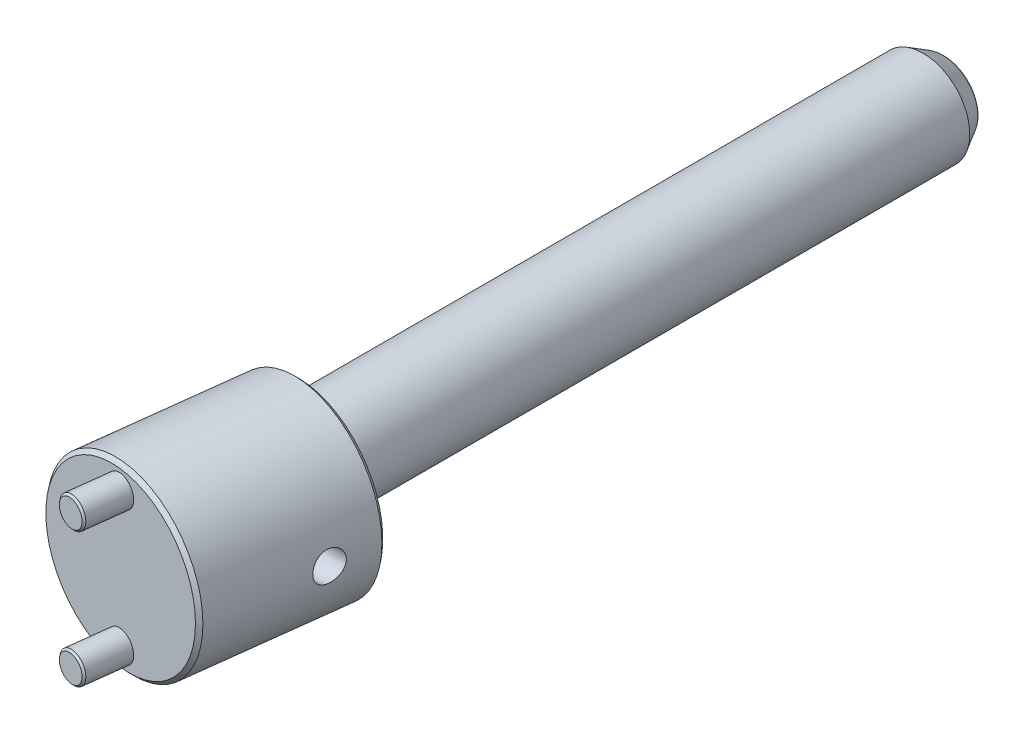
ISO-10303-21;
HEADER;
FILE_DESCRIPTION(('STEP AP214'),'2;1');
FILE_NAME('part.step','',(''),(''),'','','');
FILE_SCHEMA(('AUTOMOTIVE_DESIGN { 1 0 10303 214 1 1 1 1 }'));
ENDSEC;
DATA;
#1=APPLICATION_CONTEXT('core data for automotive mechanical design processes');
#2=APPLICATION_PROTOCOL_DEFINITION('international standard','automotive_design',2000,#1);
#3=PRODUCT_CONTEXT('',#1,'mechanical');
#4=PRODUCT('Part','Part','',(#3));
#5=PRODUCT_RELATED_PRODUCT_CATEGORY('part','',(#4));
#6=PRODUCT_DEFINITION_FORMATION('','',#4);
#7=PRODUCT_DEFINITION_CONTEXT('part definition',#1,'design');
#8=PRODUCT_DEFINITION('design','',#6,#7);
#9=PRODUCT_DEFINITION_SHAPE('','',#8);
#10=(LENGTH_UNIT() NAMED_UNIT(*) SI_UNIT(.MILLI.,.METRE.));
#11=(NAMED_UNIT(*) PLANE_ANGLE_UNIT() SI_UNIT($,.RADIAN.));
#12=(NAMED_UNIT(*) SI_UNIT($,.STERADIAN.) SOLID_ANGLE_UNIT());
#13=UNCERTAINTY_MEASURE_WITH_UNIT(LENGTH_MEASURE(1.E-05),#10,'distance_accuracy_value','');
#14=(GEOMETRIC_REPRESENTATION_CONTEXT(3) GLOBAL_UNCERTAINTY_ASSIGNED_CONTEXT((#13)) GLOBAL_UNIT_ASSIGNED_CONTEXT((#10,
#11,#12)) REPRESENTATION_CONTEXT('',''));
#15=CARTESIAN_POINT('',(0.,0.,0.));
#16=DIRECTION('',(0.,0.,1.));
#17=DIRECTION('',(1.,0.,0.));
#18=AXIS2_PLACEMENT_3D('',#15,#16,#17);
#19=CARTESIAN_POINT('',(0.,0.,-175.));
#20=DIRECTION('',(0.,0.,-1.));
#21=DIRECTION('',(0.,1.,0.));
#22=AXIS2_PLACEMENT_3D('',#19,#20,#21);
#23=PLANE('',#22);
#24=CARTESIAN_POINT('',(0.,0.,-175.));
#25=DIRECTION('',(0.,0.,1.));
#26=DIRECTION('',(-1.,0.,0.));
#27=AXIS2_PLACEMENT_3D('',#24,#25,#26);
#28=CIRCLE('',#27,7.881197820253);
#29=CARTESIAN_POINT('',(-7.881197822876,0.,-175.));
#30=VERTEX_POINT('',#29);
#31=CARTESIAN_POINT('',(7.881197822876,0.,-175.));
#32=VERTEX_POINT('',#31);
#33=EDGE_CURVE('P0_E38',#30,#32,#28,.T.);
#34=ORIENTED_EDGE('',*,*,#33,.F.);
#35=CARTESIAN_POINT('',(0.,0.,-175.));
#36=DIRECTION('',(0.,0.,1.));
#37=DIRECTION('',(1.,0.,0.));
#38=AXIS2_PLACEMENT_3D('',#35,#36,#37);
#39=CIRCLE('',#38,7.881197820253);
#40=EDGE_CURVE('P0_E42',#32,#30,#39,.T.);
#41=ORIENTED_EDGE('',*,*,#40,.F.);
#42=EDGE_LOOP('',(#34,#41));
#43=FACE_BOUND('',#42,.T.);
#44=ADVANCED_FACE('P0_F17',(#43),#23,.T.);
#45=CARTESIAN_POINT('',(0.,0.,-173.));
#46=DIRECTION('',(0.,0.,-1.));
#47=DIRECTION('',(0.999976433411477,-0.00686532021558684,0.));
#48=AXIS2_PLACEMENT_3D('',#45,#46,#47);
#49=TOROIDAL_SURFACE('',#48,7.881197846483,2.);
#50=ORIENTED_EDGE('',*,*,#33,.T.);
#51=ORIENTED_EDGE('',*,*,#40,.T.);
#52=EDGE_LOOP('',(#50,#51));
#53=FACE_BOUND('',#52,.T.);
#54=CARTESIAN_POINT('',(0.,0.,-174.000000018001));
#55=DIRECTION('',(0.,0.,1.));
#56=DIRECTION('',(1.,0.,0.));
#57=AXIS2_PLACEMENT_3D('',#54,#55,#56);
#58=CIRCLE('',#57,9.61324864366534);
#59=CARTESIAN_POINT('',(9.61324864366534,0.,-174.000000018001));
#60=VERTEX_POINT('',#59);
#61=EDGE_CURVE('P0_E48',#60,#60,#58,.T.);
#62=ORIENTED_EDGE('',*,*,#61,.F.);
#63=EDGE_LOOP('',(#62));
#64=FACE_BOUND('',#63,.T.);
#65=ADVANCED_FACE('P0_F40',(#53,#64),#49,.T.);
#66=CARTESIAN_POINT('',(0.,0.,37.5));
#67=DIRECTION('',(0.,0.,-1.));
#68=DIRECTION('',(0.,1.,0.));
#69=AXIS2_PLACEMENT_3D('',#66,#67,#68);
#70=PLANE('',#69);
#71=CARTESIAN_POINT('',(0.,0.,37.4999993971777));
#72=DIRECTION('',(0.,0.,-1.));
#73=DIRECTION('',(0.,1.,0.));
#74=AXIS2_PLACEMENT_3D('',#71,#72,#73);
#75=CIRCLE('',#74,11.4999991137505);
#76=CARTESIAN_POINT('',(0.,11.4999991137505,37.4999993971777));
#77=VERTEX_POINT('',#76);
#78=EDGE_CURVE('P0_E85',#77,#77,#75,.T.);
#79=ORIENTED_EDGE('',*,*,#78,.F.);
#80=EDGE_LOOP('',(#79));
#81=FACE_BOUND('',#80,.T.);
#82=ADVANCED_FACE('P0_F76',(#81),#70,.F.);
#83=CARTESIAN_POINT('',(4.30940107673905,0.,17.));
#84=DIRECTION('',(1.,0.,0.));
#85=DIRECTION('',(0.,0.,1.));
#86=AXIS2_PLACEMENT_3D('',#83,#84,#85);
#87=CONICAL_SURFACE('',#86,3.9999999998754,1.04719755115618);
#88=CARTESIAN_POINT('',(1.99999999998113,0.,16.9999999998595));
#89=VERTEX_POINT('',#88);
#90=VERTEX_LOOP('',#89);
#91=FACE_BOUND('',#90,.T.);
#92=CARTESIAN_POINT('',(4.309401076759,0.,17.));
#93=DIRECTION('',(1.,0.,0.));
#94=DIRECTION('',(0.,0.,1.));
#95=AXIS2_PLACEMENT_3D('',#92,#93,#94);
#96=CIRCLE('',#95,4.);
#97=CARTESIAN_POINT('',(4.309401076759,0.,21.));
#98=VERTEX_POINT('',#97);
#99=EDGE_CURVE('P0_E82',#98,#98,#96,.T.);
#100=ORIENTED_EDGE('',*,*,#99,.T.);
#101=EDGE_LOOP('',(#100));
#102=FACE_BOUND('',#101,.T.);
#103=ADVANCED_FACE('P0_F116',(#91,#102),#87,.F.);
#104=CARTESIAN_POINT('',(0.,0.,-169.000000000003));
#105=DIRECTION('',(0.,0.,1.));
#106=DIRECTION('',(0.,-1.,0.));
#107=AXIS2_PLACEMENT_3D('',#104,#105,#106);
#108=CONICAL_SURFACE('',#107,12.5000000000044,0.5235987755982);
#109=CARTESIAN_POINT('',(0.,0.,-169.));
#110=DIRECTION('',(0.,0.,-1.));
#111=DIRECTION('',(0.,1.,0.));
#112=AXIS2_PLACEMENT_3D('',#109,#110,#111);
#113=CIRCLE('',#112,12.5);
#114=CARTESIAN_POINT('',(0.,12.5,-169.));
#115=VERTEX_POINT('',#114);
#116=EDGE_CURVE('P0_E92',#115,#115,#113,.F.);
#117=ORIENTED_EDGE('',*,*,#116,.F.);
#118=EDGE_LOOP('',(#117));
#119=FACE_BOUND('',#118,.T.);
#120=ORIENTED_EDGE('',*,*,#61,.T.);
#121=EDGE_LOOP('',(#120));
#122=FACE_BOUND('',#121,.T.);
#123=ADVANCED_FACE('P0_F108',(#119,#122),#108,.T.);
#124=CARTESIAN_POINT('',(0.,0.,36.4999990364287));
#125=DIRECTION('',(0.,0.,-1.));
#126=DIRECTION('',(0.,1.,0.));
#127=AXIS2_PLACEMENT_3D('',#124,#125,#126);
#128=CONICAL_SURFACE('',#127,12.4999993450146,0.78539809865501);
#129=CARTESIAN_POINT('',(0.,0.,36.499999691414));
#130=DIRECTION('',(0.,0.,-1.));
#131=DIRECTION('',(0.,1.,0.));
#132=AXIS2_PLACEMENT_3D('',#129,#130,#131);
#133=CIRCLE('',#132,12.5);
#134=CARTESIAN_POINT('',(0.,12.5,36.499999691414));
#135=VERTEX_POINT('',#134);
#136=EDGE_CURVE('P0_E28',#135,#135,#133,.T.);
#137=ORIENTED_EDGE('',*,*,#136,.F.);
#138=EDGE_LOOP('',(#137));
#139=FACE_BOUND('',#138,.T.);
#140=ORIENTED_EDGE('',*,*,#78,.T.);
#141=EDGE_LOOP('',(#140));
#142=FACE_BOUND('',#141,.T.);
#143=ADVANCED_FACE('P0_F105',(#139,#142),#128,.T.);
#144=CARTESIAN_POINT('',(1.375,0.,17.));
#145=DIRECTION('',(1.,0.,0.));
#146=DIRECTION('',(0.,0.,1.));
#147=AXIS2_PLACEMENT_3D('',#144,#145,#146);
#148=CYLINDRICAL_SURFACE('',#147,4.);
#149=ORIENTED_EDGE('',*,*,#99,.F.);
#150=EDGE_LOOP('',(#149));
#151=FACE_BOUND('',#150,.T.);
#152=CARTESIAN_POINT('',(12.5,0.,21.));
#153=CARTESIAN_POINT('',(12.4999998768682,0.109267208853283,20.9999998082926));
#154=CARTESIAN_POINT('',(12.4985638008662,0.218537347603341,20.9955187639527));
#155=CARTESIAN_POINT('',(12.4928582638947,0.436308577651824,20.9776347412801));
#156=CARTESIAN_POINT('',(12.4885877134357,0.544809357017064,20.9642283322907));
#157=CARTESIAN_POINT('',(12.4773197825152,0.760358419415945,20.9285872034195));
#158=CARTESIAN_POINT('',(12.4703188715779,0.867404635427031,20.9063410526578));
#159=CARTESIAN_POINT('',(12.4537844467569,1.07914970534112,20.853228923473));
#160=CARTESIAN_POINT('',(12.4442499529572,1.18384763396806,20.8223596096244));
#161=CARTESIAN_POINT('',(12.412260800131,1.49277788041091,20.7173557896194));
#162=CARTESIAN_POINT('',(12.3863805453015,1.69256281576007,20.6307055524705));
#163=CARTESIAN_POINT('',(12.3281610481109,2.07458913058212,20.4268128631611));
#164=CARTESIAN_POINT('',(12.295822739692,2.25683304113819,20.3095748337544));
#165=CARTESIAN_POINT('',(12.2269279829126,2.60472253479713,20.043795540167));
#166=CARTESIAN_POINT('',(12.1902760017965,2.76972880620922,19.8944408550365));
#167=CARTESIAN_POINT('',(12.1174284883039,3.07283077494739,19.5704010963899));
#168=CARTESIAN_POINT('',(12.0812330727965,3.21091970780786,19.3957096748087));
#169=CARTESIAN_POINT('',(12.01237020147,3.45978450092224,19.0203675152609));
#170=CARTESIAN_POINT('',(11.9798194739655,3.56975347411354,18.8191582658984));
#171=CARTESIAN_POINT('',(11.9233663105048,3.75402351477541,18.399892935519));
#172=CARTESIAN_POINT('',(11.8994614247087,3.82833468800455,18.1818416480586));
#173=CARTESIAN_POINT('',(11.8640030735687,3.93682830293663,17.7422935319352));
#174=CARTESIAN_POINT('',(11.8520853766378,3.97219740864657,17.5211198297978));
#175=CARTESIAN_POINT('',(11.8408707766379,4.00551082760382,17.0756810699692));
#176=CARTESIAN_POINT('',(11.8415703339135,4.00346563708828,16.8514168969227));
#177=CARTESIAN_POINT('',(11.8551904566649,3.96293460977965,16.4160865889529));
#178=CARTESIAN_POINT('',(11.8676003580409,3.92597140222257,16.2048599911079));
#179=CARTESIAN_POINT('',(11.9024113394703,3.81912665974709,15.791778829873));
#180=CARTESIAN_POINT('',(11.9248135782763,3.74924130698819,15.5899253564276));
#181=CARTESIAN_POINT('',(11.9774670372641,3.5774893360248,15.1977500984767));
#182=CARTESIAN_POINT('',(12.0078322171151,3.47515345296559,15.0076498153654));
#183=CARTESIAN_POINT('',(12.0729382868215,3.2417276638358,14.6468343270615));
#184=CARTESIAN_POINT('',(12.107680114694,3.11063158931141,14.4761232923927));
#185=CARTESIAN_POINT('',(12.1796519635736,2.81604951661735,14.1503715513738));
#186=CARTESIAN_POINT('',(12.2169216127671,2.65131653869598,13.9964671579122));
#187=CARTESIAN_POINT('',(12.2883204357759,2.29773509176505,13.7180823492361));
#188=CARTESIAN_POINT('',(12.3224482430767,2.10887621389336,13.5936147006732));
#189=CARTESIAN_POINT('',(12.368603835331,1.8105187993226,13.4313785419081));
#190=CARTESIAN_POINT('',(12.3832112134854,1.70799133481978,13.3811846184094));
#191=CARTESIAN_POINT('',(12.4102662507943,1.49879447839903,13.2896595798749));
#192=CARTESIAN_POINT('',(12.4227147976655,1.39212681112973,13.2483248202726));
#193=CARTESIAN_POINT('',(12.4450730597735,1.17558171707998,13.1749428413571));
#194=CARTESIAN_POINT('',(12.4549867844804,1.0657096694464,13.1428809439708));
#195=CARTESIAN_POINT('',(12.4720081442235,0.843458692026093,13.0882661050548));
#196=CARTESIAN_POINT('',(12.4791170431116,0.731080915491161,13.0657088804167));
#197=CARTESIAN_POINT('',(12.4897717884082,0.515800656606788,13.0320501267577));
#198=CARTESIAN_POINT('',(12.4935992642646,0.413053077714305,13.0200402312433));
#199=CARTESIAN_POINT('',(12.498713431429,0.206871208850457,13.0040150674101));
#200=CARTESIAN_POINT('',(12.5000001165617,0.103436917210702,12.9999998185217));
#201=CARTESIAN_POINT('',(12.4999998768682,-0.109267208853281,13.0000001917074));
#202=CARTESIAN_POINT('',(12.4985638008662,-0.218537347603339,13.0044812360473));
#203=CARTESIAN_POINT('',(12.4928582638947,-0.436308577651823,13.0223652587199));
#204=CARTESIAN_POINT('',(12.4885877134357,-0.544809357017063,13.0357716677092));
#205=CARTESIAN_POINT('',(12.4773197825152,-0.760358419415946,13.0714127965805));
#206=CARTESIAN_POINT('',(12.4703188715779,-0.867404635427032,13.0936589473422));
#207=CARTESIAN_POINT('',(12.4537844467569,-1.07914970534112,13.146771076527));
#208=CARTESIAN_POINT('',(12.4442499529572,-1.18384763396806,13.1776403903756));
#209=CARTESIAN_POINT('',(12.412260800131,-1.4927778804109,13.2826442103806));
#210=CARTESIAN_POINT('',(12.3863805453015,-1.69256281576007,13.3692944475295));
#211=CARTESIAN_POINT('',(12.3281610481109,-2.07458913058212,13.5731871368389));
#212=CARTESIAN_POINT('',(12.295822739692,-2.25683304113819,13.6904251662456));
#213=CARTESIAN_POINT('',(12.2269279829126,-2.60472253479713,13.956204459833));
#214=CARTESIAN_POINT('',(12.1902760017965,-2.76972880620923,14.1055591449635));
#215=CARTESIAN_POINT('',(12.1174284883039,-3.0728307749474,14.4295989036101));
#216=CARTESIAN_POINT('',(12.0812330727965,-3.21091970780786,14.6042903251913));
#217=CARTESIAN_POINT('',(12.01237020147,-3.45978450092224,14.9796324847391));
#218=CARTESIAN_POINT('',(11.9798194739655,-3.56975347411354,15.1808417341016));
#219=CARTESIAN_POINT('',(11.9233663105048,-3.75402351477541,15.600107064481));
#220=CARTESIAN_POINT('',(11.8994614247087,-3.82833468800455,15.8181583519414));
#221=CARTESIAN_POINT('',(11.8640030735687,-3.93682830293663,16.2577064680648));
#222=CARTESIAN_POINT('',(11.8520853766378,-3.97219740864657,16.4788801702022));
#223=CARTESIAN_POINT('',(11.8408707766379,-4.00551082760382,16.9243189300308));
#224=CARTESIAN_POINT('',(11.8415703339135,-4.00346563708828,17.1485831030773));
#225=CARTESIAN_POINT('',(11.8551904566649,-3.96293460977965,17.583913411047));
#226=CARTESIAN_POINT('',(11.8676003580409,-3.92597140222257,17.7951400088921));
#227=CARTESIAN_POINT('',(11.9024113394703,-3.81912665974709,18.208221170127));
#228=CARTESIAN_POINT('',(11.9248135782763,-3.74924130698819,18.4100746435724));
#229=CARTESIAN_POINT('',(11.9774670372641,-3.5774893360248,18.8022499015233));
#230=CARTESIAN_POINT('',(12.0078322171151,-3.47515345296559,18.9923501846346));
#231=CARTESIAN_POINT('',(12.0729382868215,-3.2417276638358,19.3531656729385));
#232=CARTESIAN_POINT('',(12.107680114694,-3.11063158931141,19.5238767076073));
#233=CARTESIAN_POINT('',(12.1796519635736,-2.81604951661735,19.8496284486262));
#234=CARTESIAN_POINT('',(12.2169216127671,-2.65131653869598,20.0035328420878));
#235=CARTESIAN_POINT('',(12.2883204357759,-2.29773509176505,20.2819176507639));
#236=CARTESIAN_POINT('',(12.3224482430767,-2.10887621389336,20.4063852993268));
#237=CARTESIAN_POINT('',(12.368603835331,-1.8105187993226,20.5686214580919));
#238=CARTESIAN_POINT('',(12.3832112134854,-1.70799133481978,20.6188153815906));
#239=CARTESIAN_POINT('',(12.4102662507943,-1.49879447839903,20.7103404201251));
#240=CARTESIAN_POINT('',(12.4227147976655,-1.39212681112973,20.7516751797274));
#241=CARTESIAN_POINT('',(12.4450730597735,-1.17558171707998,20.8250571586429));
#242=CARTESIAN_POINT('',(12.4549867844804,-1.0657096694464,20.8571190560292));
#243=CARTESIAN_POINT('',(12.4720081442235,-0.843458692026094,20.9117338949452));
#244=CARTESIAN_POINT('',(12.4791170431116,-0.731080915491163,20.9342911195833));
#245=CARTESIAN_POINT('',(12.4897717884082,-0.515800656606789,20.9679498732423));
#246=CARTESIAN_POINT('',(12.4935992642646,-0.413053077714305,20.9799597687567));
#247=CARTESIAN_POINT('',(12.498713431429,-0.206871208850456,20.9959849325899));
#248=CARTESIAN_POINT('',(12.5000001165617,-0.103436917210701,21.0000001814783));
#249=CARTESIAN_POINT('',(12.5,0.,21.));
#250=B_SPLINE_CURVE_WITH_KNOTS('',3,(#152,#153,#154,#155,#156,#157,#158,#159,#160,#161,#162,
#163,#164,#165,#166,#167,#168,#169,#170,#171,#172,#173,#174,#175,#176,#177,#178,#179,#180,#181,
#182,#183,#184,#185,#186,#187,#188,#189,#190,#191,#192,#193,#194,#195,#196,#197,#198,#199,#200,
#201,#202,#203,#204,#205,#206,#207,#208,#209,#210,#211,#212,#213,#214,#215,#216,#217,#218,#219,
#220,#221,#222,#223,#224,#225,#226,#227,#228,#229,#230,#231,#232,#233,#234,#235,#236,#237,#238,
#239,#240,#241,#242,#243,#244,#245,#246,#247,#248,#249),.UNSPECIFIED.,.T.,.F.,(4,2,2,2,2,2,2,2,
2,2,2,2,2,2,2,2,2,2,2,2,2,2,2,2,2,2,2,2,2,2,2,2,2,2,2,2,2,2,2,2,2,2,2,2,2,2,2,2,4),(0.,
0.327705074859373,0.655536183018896,0.983792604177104,1.31217617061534,1.96678919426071,
2.62130761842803,3.29492000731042,3.96870146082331,4.66006760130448,5.35123768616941,
6.0207071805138,6.68998886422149,7.33137068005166,7.97282689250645,8.62401811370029,
9.27534913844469,9.95775723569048,10.6404607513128,10.9853574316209,11.3301119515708,
11.6743177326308,12.0183682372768,12.3285868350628,12.6388061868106,12.9665112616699,
13.2943423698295,13.6225987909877,13.9509823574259,14.6055953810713,15.2601138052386,
15.933726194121,16.6075076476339,17.298873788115,17.99004387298,18.6595133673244,
19.3287950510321,19.9701768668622,20.611633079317,21.2628243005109,21.9141553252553,
22.596563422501,23.2792669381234,23.6241636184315,23.9689181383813,24.3131239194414,
24.6571744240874,24.9673930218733,25.2776123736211),.UNSPECIFIED.);
#251=CARTESIAN_POINT('',(12.5,0.,21.));
#252=VERTEX_POINT('',#251);
#253=EDGE_CURVE('P0_E11',#252,#252,#250,.T.);
#254=ORIENTED_EDGE('',*,*,#253,.F.);
#255=EDGE_LOOP('',(#254));
#256=FACE_BOUND('',#255,.T.);
#257=ADVANCED_FACE('P0_F107',(#151,#256),#148,.F.);
#258=CARTESIAN_POINT('',(0.,0.,48.125));
#259=DIRECTION('',(0.,0.,-1.));
#260=DIRECTION('',(0.,1.,0.));
#261=AXIS2_PLACEMENT_3D('',#258,#259,#260);
#262=CYLINDRICAL_SURFACE('',#261,12.5);
#263=ORIENTED_EDGE('',*,*,#116,.T.);
#264=EDGE_LOOP('',(#263));
#265=FACE_BOUND('',#264,.T.);
#266=ORIENTED_EDGE('',*,*,#136,.T.);
#267=EDGE_LOOP('',(#266));
#268=FACE_BOUND('',#267,.T.);
#269=ORIENTED_EDGE('',*,*,#253,.T.);
#270=EDGE_LOOP('',(#269));
#271=FACE_BOUND('',#270,.T.);
#272=ADVANCED_FACE('P0_F102',(#265,#268,#271),#262,.T.);
#273=CLOSED_SHELL('',(#44,#65,#82,#103,#123,#143,#257,#272));
#274=MANIFOLD_SOLID_BREP('P0_B1',#273);
#275=CARTESIAN_POINT('',(-1.98382181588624,0.,57.1844773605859));
#276=DIRECTION('',(-0.121869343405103,0.,0.992546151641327));
#277=DIRECTION('',(-0.992546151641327,0.,-0.121869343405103));
#278=AXIS2_PLACEMENT_3D('',#275,#276,#277);
#279=PLANE('',#278);
#280=CARTESIAN_POINT('',(-1.98382181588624,18.,57.1844773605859));
#281=DIRECTION('',(-0.121869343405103,0.,0.992546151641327));
#282=DIRECTION('',(-0.992546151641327,0.,-0.121869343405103));
#283=AXIS2_PLACEMENT_3D('',#280,#281,#282);
#284=CIRCLE('',#283,3.50000030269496);
#285=CARTESIAN_POINT('',(-5.4577336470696,18.,56.7579346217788));
#286=VERTEX_POINT('',#285);
#287=EDGE_CURVE('P1_E17',#286,#286,#284,.F.);
#288=ORIENTED_EDGE('',*,*,#287,.F.);
#289=EDGE_LOOP('',(#288));
#290=FACE_BOUND('',#289,.T.);
#291=ADVANCED_FACE('P1_F14',(#290),#279,.T.);
#292=CARTESIAN_POINT('',(-1.98382181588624,0.,57.1844773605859));
#293=DIRECTION('',(-0.121869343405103,0.,0.992546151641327));
#294=DIRECTION('',(-0.992546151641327,0.,-0.121869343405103));
#295=AXIS2_PLACEMENT_3D('',#292,#293,#294);
#296=PLANE('',#295);
#297=CARTESIAN_POINT('',(-1.98382181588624,-18.,57.1844773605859));
#298=DIRECTION('',(-0.121869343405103,0.,0.992546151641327));
#299=DIRECTION('',(-0.992546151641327,0.,-0.121869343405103));
#300=AXIS2_PLACEMENT_3D('',#297,#298,#299);
#301=CIRCLE('',#300,3.50000030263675);
#302=CARTESIAN_POINT('',(-5.45773364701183,-18.,56.7579346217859));
#303=VERTEX_POINT('',#302);
#304=EDGE_CURVE('P1_E121',#303,#303,#301,.F.);
#305=ORIENTED_EDGE('',*,*,#304,.F.);
#306=EDGE_LOOP('',(#305));
#307=FACE_BOUND('',#306,.T.);
#308=ADVANCED_FACE('P1_F111',(#307),#296,.T.);
#309=CARTESIAN_POINT('',(-4.01046383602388E-13,0.,37.5000000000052));
#310=DIRECTION('',(0.,0.,1.));
#311=DIRECTION('',(-1.,0.,0.));
#312=AXIS2_PLACEMENT_3D('',#309,#310,#311);
#313=PLANE('',#312);
#314=CARTESIAN_POINT('',(-2.81307095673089E-12,0.,37.5000000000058));
#315=DIRECTION('',(0.,0.,1.));
#316=DIRECTION('',(-1.,0.,0.));
#317=AXIS2_PLACEMENT_3D('',#314,#315,#316);
#318=CIRCLE('',#317,12.5);
#319=CARTESIAN_POINT('',(-12.5000000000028,0.,37.5000000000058));
#320=VERTEX_POINT('',#319);
#321=EDGE_CURVE('P1_E36',#320,#320,#318,.F.);
#322=ORIENTED_EDGE('',*,*,#321,.T.);
#323=EDGE_LOOP('',(#322));
#324=FACE_BOUND('',#323,.T.);
#325=ADVANCED_FACE('P1_F108',(#324),#313,.F.);
#326=CARTESIAN_POINT('',(-1.92288700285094,18.,56.6882031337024));
#327=DIRECTION('',(0.121869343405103,0.,-0.992546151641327));
#328=DIRECTION('',(0.992546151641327,0.,0.121869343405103));
#329=AXIS2_PLACEMENT_3D('',#326,#327,#328);
#330=CONICAL_SURFACE('',#329,4.00000150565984,0.785398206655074);
#331=CARTESIAN_POINT('',(-1.9228868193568,18.,56.6882016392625));
#332=DIRECTION('',(-0.121869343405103,0.,0.992546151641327));
#333=DIRECTION('',(-0.992546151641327,0.,-0.121869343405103));
#334=AXIS2_PLACEMENT_3D('',#331,#332,#333);
#335=CIRCLE('',#334,4.);
#336=CARTESIAN_POINT('',(-5.89307142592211,18.,56.2007242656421));
#337=VERTEX_POINT('',#336);
#338=EDGE_CURVE('P1_E33',#337,#337,#335,.F.);
#339=ORIENTED_EDGE('',*,*,#338,.F.);
#340=EDGE_LOOP('',(#339));
#341=FACE_BOUND('',#340,.T.);
#342=ORIENTED_EDGE('',*,*,#287,.T.);
#343=EDGE_LOOP('',(#342));
#344=FACE_BOUND('',#343,.T.);
#345=ADVANCED_FACE('P1_F104',(#341,#344),#330,.T.);
#346=CARTESIAN_POINT('',(-1.92288700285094,-18.,56.6882031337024));
#347=DIRECTION('',(0.121869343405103,0.,-0.992546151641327));
#348=DIRECTION('',(0.992546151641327,0.,0.121869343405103));
#349=AXIS2_PLACEMENT_3D('',#346,#347,#348);
#350=CONICAL_SURFACE('',#349,4.00000150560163,0.785398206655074);
#351=CARTESIAN_POINT('',(-1.9228868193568,-18.,56.6882016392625));
#352=DIRECTION('',(-0.121869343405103,0.,0.992546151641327));
#353=DIRECTION('',(-0.992546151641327,0.,-0.121869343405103));
#354=AXIS2_PLACEMENT_3D('',#351,#352,#353);
#355=CIRCLE('',#354,4.);
#356=CARTESIAN_POINT('',(-5.89307142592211,-18.,56.2007242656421));
#357=VERTEX_POINT('',#356);
#358=EDGE_CURVE('P1_E29',#357,#357,#355,.F.);
#359=ORIENTED_EDGE('',*,*,#358,.F.);
#360=EDGE_LOOP('',(#359));
#361=FACE_BOUND('',#360,.T.);
#362=ORIENTED_EDGE('',*,*,#304,.T.);
#363=EDGE_LOOP('',(#362));
#364=FACE_BOUND('',#363,.T.);
#365=ADVANCED_FACE('P1_F99',(#361,#364),#350,.T.);
#366=CARTESIAN_POINT('',(-2.81296253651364E-12,0.,-14.0382130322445));
#367=DIRECTION('',(0.,0.,1.));
#368=DIRECTION('',(-1.,0.,0.));
#369=AXIS2_PLACEMENT_3D('',#366,#367,#368);
#370=CYLINDRICAL_SURFACE('',#369,12.5);
#371=CARTESIAN_POINT('',(-2.81382989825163E-12,0.,4.65599780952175E-12));
#372=DIRECTION('',(0.121869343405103,0.,-0.992546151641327));
#373=DIRECTION('',(0.992546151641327,0.,0.121869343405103));
#374=AXIS2_PLACEMENT_3D('',#371,#372,#373);
#375=ELLIPSE('',#374,12.5938728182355,12.5);
#376=CARTESIAN_POINT('',(12.4999999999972,0.,1.5348070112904));
#377=VERTEX_POINT('',#376);
#378=EDGE_CURVE('P1_E32',#377,#377,#375,.F.);
#379=ORIENTED_EDGE('',*,*,#378,.F.);
#380=EDGE_LOOP('',(#379));
#381=FACE_BOUND('',#380,.T.);
#382=ORIENTED_EDGE('',*,*,#321,.F.);
#383=EDGE_LOOP('',(#382));
#384=FACE_BOUND('',#383,.T.);
#385=CARTESIAN_POINT('',(12.4999999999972,0.,13.0000000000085));
#386=CARTESIAN_POINT('',(12.4999998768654,0.109267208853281,13.000000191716));
#387=CARTESIAN_POINT('',(12.4985638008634,0.218537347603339,13.0044812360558));
#388=CARTESIAN_POINT('',(12.4928582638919,0.436308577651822,13.0223652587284));
#389=CARTESIAN_POINT('',(12.4885877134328,0.544809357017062,13.0357716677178));
#390=CARTESIAN_POINT('',(12.4773197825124,0.760358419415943,13.071412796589));
#391=CARTESIAN_POINT('',(12.470318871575,0.867404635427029,13.0936589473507));
#392=CARTESIAN_POINT('',(12.453784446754,1.07914970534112,13.1467710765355));
#393=CARTESIAN_POINT('',(12.4442499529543,1.18384763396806,13.1776403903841));
#394=CARTESIAN_POINT('',(12.4122608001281,1.4927778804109,13.2826442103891));
#395=CARTESIAN_POINT('',(12.3863805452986,1.69256281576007,13.369294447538));
#396=CARTESIAN_POINT('',(12.3281610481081,2.07458913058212,13.5731871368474));
#397=CARTESIAN_POINT('',(12.2958227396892,2.25683304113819,13.6904251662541));
#398=CARTESIAN_POINT('',(12.2269279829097,2.60472253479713,13.9562044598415));
#399=CARTESIAN_POINT('',(12.1902760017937,2.76972880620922,14.105559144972));
#400=CARTESIAN_POINT('',(12.1174284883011,3.07283077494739,14.4295989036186));
#401=CARTESIAN_POINT('',(12.0812330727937,3.21091970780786,14.6042903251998));
#402=CARTESIAN_POINT('',(12.0123702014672,3.45978450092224,14.9796324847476));
#403=CARTESIAN_POINT('',(11.9798194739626,3.56975347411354,15.1808417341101));
#404=CARTESIAN_POINT('',(11.923366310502,3.75402351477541,15.6001070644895));
#405=CARTESIAN_POINT('',(11.8994614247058,3.82833468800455,15.81815835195));
#406=CARTESIAN_POINT('',(11.8640030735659,3.93682830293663,16.2577064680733));
#407=CARTESIAN_POINT('',(11.852085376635,3.97219740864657,16.4788801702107));
#408=CARTESIAN_POINT('',(11.8408707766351,4.00551082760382,16.9243189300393));
#409=CARTESIAN_POINT('',(11.8415703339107,4.00346563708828,17.1485831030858));
#410=CARTESIAN_POINT('',(11.8551904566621,3.96293460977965,17.5839134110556));
#411=CARTESIAN_POINT('',(11.8676003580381,3.92597140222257,17.7951400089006));
#412=CARTESIAN_POINT('',(11.9024113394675,3.81912665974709,18.2082211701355));
#413=CARTESIAN_POINT('',(11.9248135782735,3.74924130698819,18.4100746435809));
#414=CARTESIAN_POINT('',(11.9774670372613,3.5774893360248,18.8022499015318));
#415=CARTESIAN_POINT('',(12.0078322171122,3.47515345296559,18.9923501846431));
#416=CARTESIAN_POINT('',(12.0729382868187,3.2417276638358,19.353165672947));
#417=CARTESIAN_POINT('',(12.1076801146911,3.11063158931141,19.5238767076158));
#418=CARTESIAN_POINT('',(12.1796519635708,2.81604951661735,19.8496284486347));
#419=CARTESIAN_POINT('',(12.2169216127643,2.65131653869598,20.0035328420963));
#420=CARTESIAN_POINT('',(12.288320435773,2.29773509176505,20.2819176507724));
#421=CARTESIAN_POINT('',(12.3224482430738,2.10887621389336,20.4063852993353));
#422=CARTESIAN_POINT('',(12.3686038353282,1.81051879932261,20.5686214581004));
#423=CARTESIAN_POINT('',(12.3832112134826,1.70799133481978,20.6188153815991));
#424=CARTESIAN_POINT('',(12.4102662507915,1.49879447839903,20.7103404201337));
#425=CARTESIAN_POINT('',(12.4227147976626,1.39212681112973,20.7516751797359));
#426=CARTESIAN_POINT('',(12.4450730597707,1.17558171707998,20.8250571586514));
#427=CARTESIAN_POINT('',(12.4549867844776,1.0657096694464,20.8571190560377));
#428=CARTESIAN_POINT('',(12.4720081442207,0.843458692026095,20.9117338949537));
#429=CARTESIAN_POINT('',(12.4791170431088,0.731080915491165,20.9342911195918));
#430=CARTESIAN_POINT('',(12.4897717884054,0.515800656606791,20.9679498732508));
#431=CARTESIAN_POINT('',(12.4935992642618,0.413053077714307,20.9799597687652));
#432=CARTESIAN_POINT('',(12.4987134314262,0.206871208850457,20.9959849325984));
#433=CARTESIAN_POINT('',(12.5000001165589,0.103436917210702,21.0000001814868));
#434=CARTESIAN_POINT('',(12.4999998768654,-0.109267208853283,20.9999998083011));
#435=CARTESIAN_POINT('',(12.4985638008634,-0.218537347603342,20.9955187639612));
#436=CARTESIAN_POINT('',(12.4928582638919,-0.436308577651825,20.9776347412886));
#437=CARTESIAN_POINT('',(12.4885877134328,-0.544809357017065,20.9642283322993));
#438=CARTESIAN_POINT('',(12.4773197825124,-0.760358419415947,20.928587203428));
#439=CARTESIAN_POINT('',(12.470318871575,-0.867404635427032,20.9063410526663));
#440=CARTESIAN_POINT('',(12.453784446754,-1.07914970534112,20.8532289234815));
#441=CARTESIAN_POINT('',(12.4442499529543,-1.18384763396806,20.8223596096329));
#442=CARTESIAN_POINT('',(12.4122608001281,-1.4927778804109,20.7173557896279));
#443=CARTESIAN_POINT('',(12.3863805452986,-1.69256281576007,20.630705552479));
#444=CARTESIAN_POINT('',(12.3281610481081,-2.07458913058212,20.4268128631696));
#445=CARTESIAN_POINT('',(12.2958227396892,-2.25683304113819,20.3095748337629));
#446=CARTESIAN_POINT('',(12.2269279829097,-2.60472253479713,20.0437955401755));
#447=CARTESIAN_POINT('',(12.1902760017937,-2.76972880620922,19.894440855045));
#448=CARTESIAN_POINT('',(12.1174284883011,-3.07283077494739,19.5704010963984));
#449=CARTESIAN_POINT('',(12.0812330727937,-3.21091970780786,19.3957096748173));
#450=CARTESIAN_POINT('',(12.0123702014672,-3.45978450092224,19.0203675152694));
#451=CARTESIAN_POINT('',(11.9798194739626,-3.56975347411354,18.8191582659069));
#452=CARTESIAN_POINT('',(11.923366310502,-3.75402351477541,18.3998929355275));
#453=CARTESIAN_POINT('',(11.8994614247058,-3.82833468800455,18.1818416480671));
#454=CARTESIAN_POINT('',(11.8640030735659,-3.93682830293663,17.7422935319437));
#455=CARTESIAN_POINT('',(11.852085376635,-3.97219740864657,17.5211198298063));
#456=CARTESIAN_POINT('',(11.8408707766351,-4.00551082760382,17.0756810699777));
#457=CARTESIAN_POINT('',(11.8415703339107,-4.00346563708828,16.8514168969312));
#458=CARTESIAN_POINT('',(11.8551904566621,-3.96293460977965,16.4160865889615));
#459=CARTESIAN_POINT('',(11.8676003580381,-3.92597140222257,16.2048599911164));
#460=CARTESIAN_POINT('',(11.9024113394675,-3.81912665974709,15.7917788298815));
#461=CARTESIAN_POINT('',(11.9248135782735,-3.74924130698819,15.5899253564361));
#462=CARTESIAN_POINT('',(11.9774670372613,-3.5774893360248,15.1977500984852));
#463=CARTESIAN_POINT('',(12.0078322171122,-3.47515345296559,15.0076498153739));
#464=CARTESIAN_POINT('',(12.0729382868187,-3.2417276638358,14.64683432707));
#465=CARTESIAN_POINT('',(12.1076801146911,-3.11063158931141,14.4761232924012));
#466=CARTESIAN_POINT('',(12.1796519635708,-2.81604951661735,14.1503715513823));
#467=CARTESIAN_POINT('',(12.2169216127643,-2.65131653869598,13.9964671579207));
#468=CARTESIAN_POINT('',(12.288320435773,-2.29773509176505,13.7180823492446));
#469=CARTESIAN_POINT('',(12.3224482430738,-2.10887621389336,13.5936147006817));
#470=CARTESIAN_POINT('',(12.3686038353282,-1.81051879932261,13.4313785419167));
#471=CARTESIAN_POINT('',(12.3832112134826,-1.70799133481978,13.3811846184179));
#472=CARTESIAN_POINT('',(12.4102662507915,-1.49879447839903,13.2896595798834));
#473=CARTESIAN_POINT('',(12.4227147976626,-1.39212681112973,13.2483248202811));
#474=CARTESIAN_POINT('',(12.4450730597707,-1.17558171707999,13.1749428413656));
#475=CARTESIAN_POINT('',(12.4549867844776,-1.06570966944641,13.1428809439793));
#476=CARTESIAN_POINT('',(12.4720081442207,-0.843458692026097,13.0882661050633));
#477=CARTESIAN_POINT('',(12.4791170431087,-0.731080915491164,13.0657088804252));
#478=CARTESIAN_POINT('',(12.4897717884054,-0.515800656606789,13.0320501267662));
#479=CARTESIAN_POINT('',(12.4935992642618,-0.413053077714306,13.0200402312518));
#480=CARTESIAN_POINT('',(12.4987134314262,-0.206871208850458,13.0040150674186));
#481=CARTESIAN_POINT('',(12.5000001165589,-0.103436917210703,12.9999998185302));
#482=CARTESIAN_POINT('',(12.4999999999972,0.,13.0000000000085));
#483=B_SPLINE_CURVE_WITH_KNOTS('',3,(#385,#386,#387,#388,#389,#390,#391,#392,#393,#394,#395,
#396,#397,#398,#399,#400,#401,#402,#403,#404,#405,#406,#407,#408,#409,#410,#411,#412,#413,#414,
#415,#416,#417,#418,#419,#420,#421,#422,#423,#424,#425,#426,#427,#428,#429,#430,#431,#432,#433,
#434,#435,#436,#437,#438,#439,#440,#441,#442,#443,#444,#445,#446,#447,#448,#449,#450,#451,#452,
#453,#454,#455,#456,#457,#458,#459,#460,#461,#462,#463,#464,#465,#466,#467,#468,#469,#470,#471,
#472,#473,#474,#475,#476,#477,#478,#479,#480,#481,#482),.UNSPECIFIED.,.T.,.F.,(4,2,2,2,2,2,2,2,
2,2,2,2,2,2,2,2,2,2,2,2,2,2,2,2,2,2,2,2,2,2,2,2,2,2,2,2,2,2,2,2,2,2,2,2,2,2,2,2,4),(0.,
0.327705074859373,0.655536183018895,0.983792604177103,1.31217617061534,1.9667891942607,
2.62130761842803,3.29492000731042,3.96870146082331,4.66006760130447,5.35123768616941,
6.0207071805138,6.68998886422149,7.33137068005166,7.97282689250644,8.62401811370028,
9.27534913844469,9.95775723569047,10.6404607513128,10.9853574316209,11.3301119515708,
11.6743177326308,12.0183682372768,12.3285868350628,12.6388061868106,12.9665112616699,
13.2943423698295,13.6225987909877,13.9509823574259,14.6055953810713,15.2601138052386,
15.933726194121,16.6075076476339,17.298873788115,17.99004387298,18.6595133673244,
19.3287950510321,19.9701768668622,20.611633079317,21.2628243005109,21.9141553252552,
22.596563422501,23.2792669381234,23.6241636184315,23.9689181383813,24.3131239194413,
24.6571744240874,24.9673930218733,25.2776123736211),.UNSPECIFIED.);
#484=CARTESIAN_POINT('',(12.4999999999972,0.,13.0000000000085));
#485=VERTEX_POINT('',#484);
#486=EDGE_CURVE('P1_E84',#485,#485,#483,.T.);
#487=ORIENTED_EDGE('',*,*,#486,.T.);
#488=EDGE_LOOP('',(#487));
#489=FACE_BOUND('',#488,.T.);
#490=ADVANCED_FACE('P1_F93',(#381,#384,#489),#370,.F.);
#491=CARTESIAN_POINT('',(-0.521389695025,18.,45.27392354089));
#492=DIRECTION('',(-0.121869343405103,0.,0.992546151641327));
#493=DIRECTION('',(-0.992546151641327,0.,-0.121869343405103));
#494=AXIS2_PLACEMENT_3D('',#491,#492,#493);
#495=CYLINDRICAL_SURFACE('',#494,4.);
#496=CARTESIAN_POINT('',(-0.521389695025,18.,45.27392354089));
#497=DIRECTION('',(-0.121869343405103,0.,0.992546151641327));
#498=DIRECTION('',(-0.992546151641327,0.,-0.121869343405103));
#499=AXIS2_PLACEMENT_3D('',#496,#497,#498);
#500=CIRCLE('',#499,4.);
#501=CARTESIAN_POINT('',(-4.49157430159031,18.,44.7864461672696));
#502=VERTEX_POINT('',#501);
#503=EDGE_CURVE('P1_E80',#502,#502,#500,.T.);
#504=ORIENTED_EDGE('',*,*,#503,.T.);
#505=EDGE_LOOP('',(#504));
#506=FACE_BOUND('',#505,.T.);
#507=ORIENTED_EDGE('',*,*,#338,.T.);
#508=EDGE_LOOP('',(#507));
#509=FACE_BOUND('',#508,.T.);
#510=ADVANCED_FACE('P1_F98',(#506,#509),#495,.T.);
#511=CARTESIAN_POINT('',(-0.521389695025,-18.,45.27392354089));
#512=DIRECTION('',(-0.121869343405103,0.,0.992546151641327));
#513=DIRECTION('',(-0.992546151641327,0.,-0.121869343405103));
#514=AXIS2_PLACEMENT_3D('',#511,#512,#513);
#515=CYLINDRICAL_SURFACE('',#514,4.);
#516=CARTESIAN_POINT('',(-0.521389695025,-18.,45.27392354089));
#517=DIRECTION('',(-0.121869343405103,0.,0.992546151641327));
#518=DIRECTION('',(-0.992546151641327,0.,-0.121869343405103));
#519=AXIS2_PLACEMENT_3D('',#516,#517,#518);
#520=CIRCLE('',#519,4.);
#521=CARTESIAN_POINT('',(-4.49157430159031,-18.,44.7864461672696));
#522=VERTEX_POINT('',#521);
#523=EDGE_CURVE('P1_E76',#522,#522,#520,.T.);
#524=ORIENTED_EDGE('',*,*,#523,.T.);
#525=EDGE_LOOP('',(#524));
#526=FACE_BOUND('',#525,.T.);
#527=ORIENTED_EDGE('',*,*,#358,.T.);
#528=EDGE_LOOP('',(#527));
#529=FACE_BOUND('',#528,.T.);
#530=ADVANCED_FACE('P1_F178',(#526,#529),#515,.T.);
#531=CARTESIAN_POINT('',(4.96273075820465,0.,0.609346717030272));
#532=DIRECTION('',(0.121869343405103,0.,-0.992546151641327));
#533=DIRECTION('',(0.992546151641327,0.,0.121869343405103));
#534=AXIS2_PLACEMENT_3D('',#531,#532,#533);
#535=PLANE('',#534);
#536=ORIENTED_EDGE('',*,*,#378,.T.);
#537=EDGE_LOOP('',(#536));
#538=FACE_BOUND('',#537,.T.);
#539=CARTESIAN_POINT('',(4.96273073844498,0.,0.609346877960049));
#540=DIRECTION('',(-0.121869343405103,0.,0.992546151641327));
#541=DIRECTION('',(-0.992546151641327,0.,-0.121869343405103));
#542=AXIS2_PLACEMENT_3D('',#539,#540,#541);
#543=CIRCLE('',#542,22.9999993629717);
#544=CARTESIAN_POINT('',(-17.8658301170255,0.,-2.19364794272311));
#545=VERTEX_POINT('',#544);
#546=EDGE_CURVE('P1_E46',#545,#545,#543,.T.);
#547=ORIENTED_EDGE('',*,*,#546,.F.);
#548=EDGE_LOOP('',(#547));
#549=FACE_BOUND('',#548,.T.);
#550=ADVANCED_FACE('P1_F71',(#538,#549),#535,.T.);
#551=CARTESIAN_POINT('',(-4.23226545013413,0.,17.0000000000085));
#552=DIRECTION('',(1.,0.,0.));
#553=DIRECTION('',(0.,0.,1.));
#554=AXIS2_PLACEMENT_3D('',#551,#552,#553);
#555=CYLINDRICAL_SURFACE('',#554,4.);
#556=ORIENTED_EDGE('',*,*,#486,.F.);
#557=EDGE_LOOP('',(#556));
#558=FACE_BOUND('',#557,.T.);
#559=CARTESIAN_POINT('',(26.6393091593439,0.,21.0000000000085));
#560=CARTESIAN_POINT('',(26.639305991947,0.224479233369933,20.9999898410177));
#561=CARTESIAN_POINT('',(26.6384301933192,0.449232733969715,20.9810287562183));
#562=CARTESIAN_POINT('',(26.6352035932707,0.892656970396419,20.9056265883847));
#563=CARTESIAN_POINT('',(26.6328498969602,1.11131488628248,20.8491119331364));
#564=CARTESIAN_POINT('',(26.6275033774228,1.53588834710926,20.7002135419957));
#565=CARTESIAN_POINT('',(26.6245110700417,1.74181400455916,20.6078587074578));
#566=CARTESIAN_POINT('',(26.6191570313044,2.1351563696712,20.3899338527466));
#567=CARTESIAN_POINT('',(26.6167950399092,2.32258068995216,20.2643775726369));
#568=CARTESIAN_POINT('',(26.6142486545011,2.67379960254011,19.983516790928));
#569=CARTESIAN_POINT('',(26.6140652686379,2.83758322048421,19.8281985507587));
#570=CARTESIAN_POINT('',(26.6175057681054,3.13673998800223,19.4922771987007));
#571=CARTESIAN_POINT('',(26.6211297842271,3.27211216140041,19.3116732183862));
#572=CARTESIAN_POINT('',(26.6336241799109,3.51000949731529,18.9313006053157));
#573=CARTESIAN_POINT('',(26.6424705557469,3.61268165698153,18.731623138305));
#574=CARTESIAN_POINT('',(26.6664456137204,3.78314236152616,18.3182599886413));
#575=CARTESIAN_POINT('',(26.681573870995,3.85093326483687,18.1045752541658));
#576=CARTESIAN_POINT('',(26.7184744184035,3.94960597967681,17.6706962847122));
#577=CARTESIAN_POINT('',(26.7402085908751,3.98069467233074,17.4505457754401));
#578=CARTESIAN_POINT('',(26.7901200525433,4.00610305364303,17.0088691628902));
#579=CARTESIAN_POINT('',(26.8182975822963,4.00042136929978,16.7873430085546));
#580=CARTESIAN_POINT('',(26.8804100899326,3.95264295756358,16.3473416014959));
#581=CARTESIAN_POINT('',(26.9143875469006,3.91026741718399,16.1289027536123));
#582=CARTESIAN_POINT('',(26.9863797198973,3.79023863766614,15.7026400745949));
#583=CARTESIAN_POINT('',(27.0243950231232,3.7125802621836,15.4948177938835));
#584=CARTESIAN_POINT('',(27.1032627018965,3.52217575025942,15.0907528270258));
#585=CARTESIAN_POINT('',(27.1441588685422,3.40870135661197,14.894861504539));
#586=CARTESIAN_POINT('',(27.2254818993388,3.1503820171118,14.5249173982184));
#587=CARTESIAN_POINT('',(27.2659087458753,3.00553589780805,14.3508654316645));
#588=CARTESIAN_POINT('',(27.3440736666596,2.68612895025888,14.0273060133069));
#589=CARTESIAN_POINT('',(27.381773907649,2.51123422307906,13.8781161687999));
#590=CARTESIAN_POINT('',(27.4337815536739,2.23125974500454,13.6781466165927));
#591=CARTESIAN_POINT('',(27.450371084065,2.13491704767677,13.6154210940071));
#592=CARTESIAN_POINT('',(27.4817185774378,1.93698110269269,13.4983865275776));
#593=CARTESIAN_POINT('',(27.4964773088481,1.83539008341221,13.44407395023));
#594=CARTESIAN_POINT('',(27.5236175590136,1.6295373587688,13.3452199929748));
#595=CARTESIAN_POINT('',(27.5360369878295,1.52535630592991,13.3005207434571));
#596=CARTESIAN_POINT('',(27.5585657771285,1.31339645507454,13.2200753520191));
#597=CARTESIAN_POINT('',(27.5686761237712,1.20561921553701,13.1843253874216));
#598=CARTESIAN_POINT('',(27.5863649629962,0.987433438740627,13.1221370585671));
#599=CARTESIAN_POINT('',(27.5939482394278,0.877030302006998,13.0956810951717));
#600=CARTESIAN_POINT('',(27.6064446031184,0.654275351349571,13.0522425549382));
#601=CARTESIAN_POINT('',(27.6113591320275,0.541924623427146,13.0352548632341));
#602=CARTESIAN_POINT('',(27.6171147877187,0.357821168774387,13.0153923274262));
#603=CARTESIAN_POINT('',(27.6187899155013,0.286393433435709,13.0096226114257));
#604=CARTESIAN_POINT('',(27.6210254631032,0.143313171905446,13.0019262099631));
#605=CARTESIAN_POINT('',(27.6215858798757,0.0716606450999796,12.9999995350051));
#606=CARTESIAN_POINT('',(27.6215852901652,-0.109468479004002,13.0000007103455));
#607=CARTESIAN_POINT('',(27.6202766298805,-0.218955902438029,13.0044984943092));
#608=CARTESIAN_POINT('',(27.6150670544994,-0.43717325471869,13.0224534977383));
#609=CARTESIAN_POINT('',(27.6111648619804,-0.545902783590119,13.0359151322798));
#610=CARTESIAN_POINT('',(27.6008359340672,-0.761964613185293,13.071716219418));
#611=CARTESIAN_POINT('',(27.5944049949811,-0.869294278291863,13.094070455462));
#612=CARTESIAN_POINT('',(27.5791504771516,-1.08161302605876,13.1474528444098));
#613=CARTESIAN_POINT('',(27.5703259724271,-1.18660118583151,13.17848435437));
#614=CARTESIAN_POINT('',(27.5405499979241,-1.49644958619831,13.2840790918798));
#615=CARTESIAN_POINT('',(27.5162629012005,-1.69685766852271,13.3712537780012));
#616=CARTESIAN_POINT('',(27.4606241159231,-2.07990676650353,13.5763671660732));
#617=CARTESIAN_POINT('',(27.4292747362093,-2.26255356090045,13.6942958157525));
#618=CARTESIAN_POINT('',(27.3609324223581,-2.60967331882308,13.9605149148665));
#619=CARTESIAN_POINT('',(27.3238296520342,-2.77365281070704,14.1094212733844));
#620=CARTESIAN_POINT('',(27.24702335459,-3.07461091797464,14.4318415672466));
#621=CARTESIAN_POINT('',(27.2073191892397,-3.21158287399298,14.6053615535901));
#622=CARTESIAN_POINT('',(27.1265899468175,-3.45890817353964,14.9782378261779));
#623=CARTESIAN_POINT('',(27.0855619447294,-3.56830880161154,15.1782265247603));
#624=CARTESIAN_POINT('',(27.0059603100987,-3.75175132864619,15.5942791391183));
#625=CARTESIAN_POINT('',(26.9673867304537,-3.82579246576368,15.8103434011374));
#626=CARTESIAN_POINT('',(26.8947754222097,-3.93629157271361,16.253151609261));
#627=CARTESIAN_POINT('',(26.860747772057,-3.97266720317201,16.4799178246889));
#628=CARTESIAN_POINT('',(26.798932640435,-4.00606783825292,16.9371695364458));
#629=CARTESIAN_POINT('',(26.7711443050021,-4.00309823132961,17.1676545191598));
#630=CARTESIAN_POINT('',(26.7231719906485,-3.95797233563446,17.6206211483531));
#631=CARTESIAN_POINT('',(26.7028407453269,-3.91663923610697,17.8431692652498));
#632=CARTESIAN_POINT('',(26.6690241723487,-3.79686513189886,18.2785871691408));
#633=CARTESIAN_POINT('',(26.6555383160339,-3.71842699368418,18.4914577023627));
#634=CARTESIAN_POINT('',(26.6349071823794,-3.52809508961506,18.8979271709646));
#635=CARTESIAN_POINT('',(26.6276662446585,-3.41674249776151,19.091775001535));
#636=CARTESIAN_POINT('',(26.6179988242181,-3.16328353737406,19.4583082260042));
#637=CARTESIAN_POINT('',(26.6155720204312,-3.02117922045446,19.6309950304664));
#638=CARTESIAN_POINT('',(26.6140389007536,-2.71001984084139,19.9505242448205));
#639=CARTESIAN_POINT('',(26.6149368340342,-2.54093055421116,20.0973333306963));
#640=CARTESIAN_POINT('',(26.6184724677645,-2.18058418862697,20.3607854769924));
#641=CARTESIAN_POINT('',(26.6211109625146,-1.98931702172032,20.4774147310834));
#642=CARTESIAN_POINT('',(26.626684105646,-1.58862131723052,20.6778882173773));
#643=CARTESIAN_POINT('',(26.6296207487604,-1.37907198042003,20.7614904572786));
#644=CARTESIAN_POINT('',(26.6345931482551,-0.949179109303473,20.8922176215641));
#645=CARTESIAN_POINT('',(26.6366306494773,-0.728857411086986,20.9394133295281));
#646=CARTESIAN_POINT('',(26.6383483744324,-0.422435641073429,20.9785354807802));
#647=CARTESIAN_POINT('',(26.6387064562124,-0.338160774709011,20.9865783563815));
#648=CARTESIAN_POINT('',(26.6391874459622,-0.169270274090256,20.9973125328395));
#649=CARTESIAN_POINT('',(26.639310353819,-0.0846546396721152,21.0000038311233));
#650=CARTESIAN_POINT('',(26.6393091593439,0.,21.0000000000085));
#651=B_SPLINE_CURVE_WITH_KNOTS('',3,(#559,#560,#561,#562,#563,#564,#565,#566,#567,#568,#569,
#570,#571,#572,#573,#574,#575,#576,#577,#578,#579,#580,#581,#582,#583,#584,#585,#586,#587,#588,
#589,#590,#591,#592,#593,#594,#595,#596,#597,#598,#599,#600,#601,#602,#603,#604,#605,#606,#607,
#608,#609,#610,#611,#612,#613,#614,#615,#616,#617,#618,#619,#620,#621,#622,#623,#624,#625,#626,
#627,#628,#629,#630,#631,#632,#633,#634,#635,#636,#637,#638,#639,#640,#641,#642,#643,#644,#645,
#646,#647,#648,#649,#650),.UNSPECIFIED.,.T.,.F.,(4,2,2,2,2,2,2,2,2,2,2,2,2,2,2,2,2,2,2,2,2,2,2,
2,2,2,2,2,2,2,2,2,2,2,2,2,2,2,2,2,2,2,2,2,2,4),(0.,0.673118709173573,1.3475600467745,
2.02145864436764,2.69507879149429,3.36901064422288,4.04296564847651,4.71384678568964,
5.38468255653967,6.05171866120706,6.71877967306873,7.39095417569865,8.06322656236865,
8.75015979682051,9.43711873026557,10.1322735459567,10.4803751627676,10.8283301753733,
11.1700404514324,11.5116045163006,11.8525182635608,12.1932476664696,12.4081846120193,
12.6231221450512,12.9514597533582,13.2799592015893,13.6090070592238,13.9381823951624,
14.5945366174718,15.2506765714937,15.9213827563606,16.592254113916,17.283844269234,
17.9754493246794,18.668563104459,19.3615819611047,20.0400657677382,20.7184971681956,
21.3863416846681,22.0541416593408,22.7227954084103,23.3917545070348,24.0655280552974,
24.7379882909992,24.9918317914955,25.2456754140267),.UNSPECIFIED.);
#652=CARTESIAN_POINT('',(26.6393091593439,0.,21.0000000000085));
#653=VERTEX_POINT('',#652);
#654=EDGE_CURVE('P1_E39',#653,#653,#651,.T.);
#655=ORIENTED_EDGE('',*,*,#654,.F.);
#656=EDGE_LOOP('',(#655));
#657=FACE_BOUND('',#656,.T.);
#658=ADVANCED_FACE('P1_F48',(#558,#657),#555,.F.);
#659=CARTESIAN_POINT('',(-0.521389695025,0.,45.27392354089));
#660=DIRECTION('',(0.121869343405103,0.,-0.992546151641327));
#661=DIRECTION('',(0.992546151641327,0.,0.121869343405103));
#662=AXIS2_PLACEMENT_3D('',#659,#660,#661);
#663=PLANE('',#662);
#664=ORIENTED_EDGE('',*,*,#523,.F.);
#665=EDGE_LOOP('',(#664));
#666=FACE_BOUND('',#665,.T.);
#667=ORIENTED_EDGE('',*,*,#503,.F.);
#668=EDGE_LOOP('',(#667));
#669=FACE_BOUND('',#668,.T.);
#670=CARTESIAN_POINT('',(-0.521389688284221,0.,45.2739234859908));
#671=DIRECTION('',(0.121869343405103,0.,-0.992546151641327));
#672=DIRECTION('',(0.992546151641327,0.,0.121869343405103));
#673=AXIS2_PLACEMENT_3D('',#670,#671,#672);
#674=CIRCLE('',#673,22.9999993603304);
#675=CARTESIAN_POINT('',(22.3071711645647,0.,48.076918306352));
#676=VERTEX_POINT('',#675);
#677=EDGE_CURVE('P1_E26',#676,#676,#674,.T.);
#678=ORIENTED_EDGE('',*,*,#677,.F.);
#679=EDGE_LOOP('',(#678));
#680=FACE_BOUND('',#679,.T.);
#681=ADVANCED_FACE('P1_F63',(#666,#669,#680),#663,.F.);
#682=CARTESIAN_POINT('',(4.84086133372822,0.,1.60189352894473));
#683=DIRECTION('',(-0.121869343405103,0.,0.992546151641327));
#684=DIRECTION('',(-0.992546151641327,0.,-0.121869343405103));
#685=AXIS2_PLACEMENT_3D('',#682,#683,#684);
#686=CONICAL_SURFACE('',#685,23.9999998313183,0.785398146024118);
#687=ORIENTED_EDGE('',*,*,#546,.T.);
#688=EDGE_LOOP('',(#687));
#689=FACE_BOUND('',#688,.T.);
#690=CARTESIAN_POINT('',(4.84086135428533,0.,1.60189336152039));
#691=DIRECTION('',(0.121869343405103,0.,-0.992546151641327));
#692=DIRECTION('',(0.992546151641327,0.,0.121869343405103));
#693=AXIS2_PLACEMENT_3D('',#690,#691,#692);
#694=CIRCLE('',#693,24.);
#695=CARTESIAN_POINT('',(28.6619689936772,0.,4.52675760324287));
#696=VERTEX_POINT('',#695);
#697=EDGE_CURVE('P1_E21',#696,#696,#694,.F.);
#698=ORIENTED_EDGE('',*,*,#697,.F.);
#699=EDGE_LOOP('',(#698));
#700=FACE_BOUND('',#699,.T.);
#701=ADVANCED_FACE('P1_F60',(#689,#700),#686,.T.);
#702=CARTESIAN_POINT('',(-0.399520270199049,0.,44.2813767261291));
#703=DIRECTION('',(0.121869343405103,0.,-0.992546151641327));
#704=DIRECTION('',(0.992546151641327,0.,0.121869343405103));
#705=AXIS2_PLACEMENT_3D('',#702,#703,#704);
#706=CONICAL_SURFACE('',#705,23.9999999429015,0.785398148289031);
#707=CARTESIAN_POINT('',(-0.399520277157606,0.,44.281376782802));
#708=DIRECTION('',(0.121869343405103,0.,-0.992546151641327));
#709=DIRECTION('',(0.992546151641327,0.,0.121869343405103));
#710=AXIS2_PLACEMENT_3D('',#707,#708,#709);
#711=CIRCLE('',#710,24.);
#712=CARTESIAN_POINT('',(23.4215873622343,0.,47.2062410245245));
#713=VERTEX_POINT('',#712);
#714=EDGE_CURVE('P1_E9',#713,#713,#711,.T.);
#715=ORIENTED_EDGE('',*,*,#714,.F.);
#716=EDGE_LOOP('',(#715));
#717=FACE_BOUND('',#716,.T.);
#718=ORIENTED_EDGE('',*,*,#677,.T.);
#719=EDGE_LOOP('',(#718));
#720=FACE_BOUND('',#719,.T.);
#721=ADVANCED_FACE('P1_F56',(#717,#720),#706,.T.);
#722=CARTESIAN_POINT('',(-0.795595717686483,0.,47.507152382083));
#723=DIRECTION('',(0.121869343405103,0.,-0.992546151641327));
#724=DIRECTION('',(0.992546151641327,0.,0.121869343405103));
#725=AXIS2_PLACEMENT_3D('',#722,#723,#724);
#726=CYLINDRICAL_SURFACE('',#725,24.);
#727=ORIENTED_EDGE('',*,*,#697,.T.);
#728=EDGE_LOOP('',(#727));
#729=FACE_BOUND('',#728,.T.);
#730=ORIENTED_EDGE('',*,*,#714,.T.);
#731=EDGE_LOOP('',(#730));
#732=FACE_BOUND('',#731,.T.);
#733=ORIENTED_EDGE('',*,*,#654,.T.);
#734=EDGE_LOOP('',(#733));
#735=FACE_BOUND('',#734,.T.);
#736=ADVANCED_FACE('P1_F52',(#729,#732,#735),#726,.T.);
#737=CLOSED_SHELL('',(#291,#308,#325,#345,#365,#490,#510,#530,#550,#658,#681,#701,#721,#736));
#738=MANIFOLD_SOLID_BREP('P1_B1',#737);
#739=ADVANCED_BREP_SHAPE_REPRESENTATION('',(#18,#274,#738),#14);
#740=SHAPE_DEFINITION_REPRESENTATION(#9,#739);
ENDSEC;
END-ISO-10303-21;
